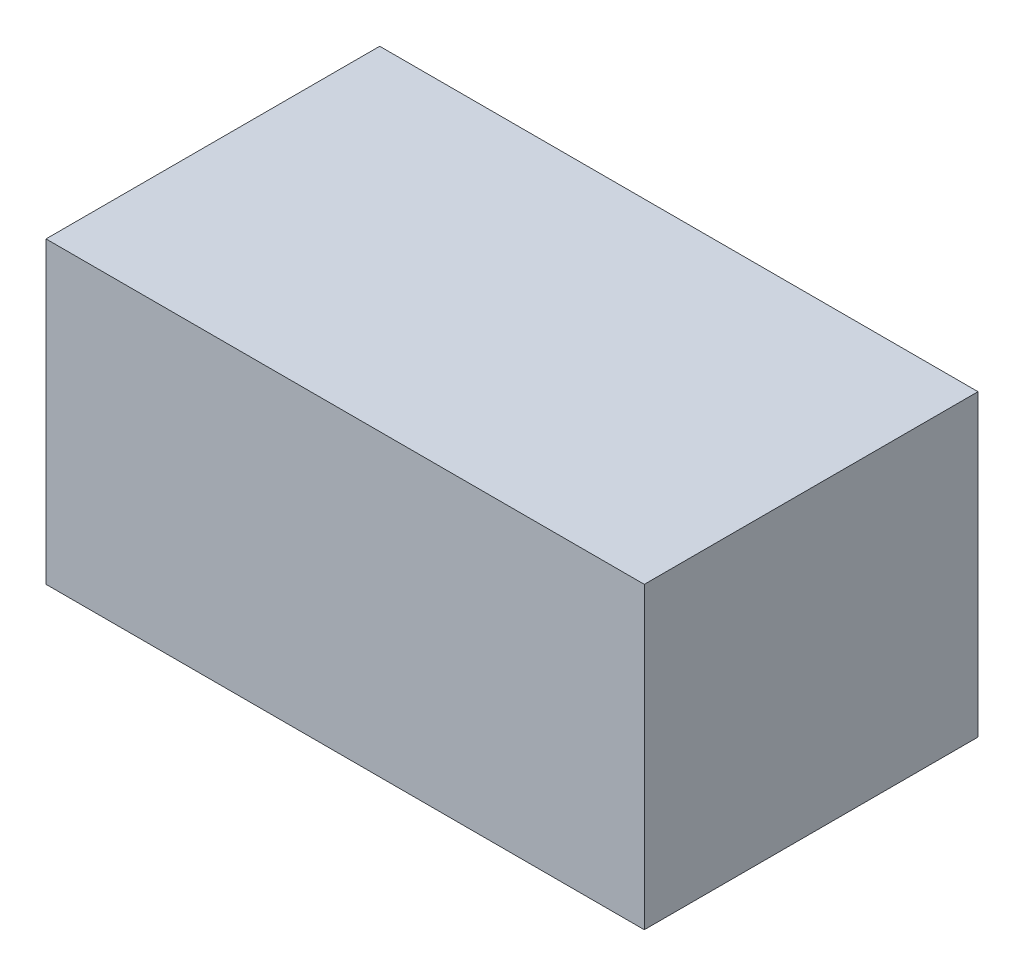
ISO-10303-21;
HEADER;
FILE_DESCRIPTION(('STEP AP214'),'2;1');
FILE_NAME('part.step','',(''),(''),'','','');
FILE_SCHEMA(('AUTOMOTIVE_DESIGN { 1 0 10303 214 1 1 1 1 }'));
ENDSEC;
DATA;
#1=APPLICATION_CONTEXT('core data for automotive mechanical design processes');
#2=APPLICATION_PROTOCOL_DEFINITION('international standard','automotive_design',2000,#1);
#3=PRODUCT_CONTEXT('',#1,'mechanical');
#4=PRODUCT('Part','Part','',(#3));
#5=PRODUCT_RELATED_PRODUCT_CATEGORY('part','',(#4));
#6=PRODUCT_DEFINITION_FORMATION('','',#4);
#7=PRODUCT_DEFINITION_CONTEXT('part definition',#1,'design');
#8=PRODUCT_DEFINITION('design','',#6,#7);
#9=PRODUCT_DEFINITION_SHAPE('','',#8);
#10=(LENGTH_UNIT() NAMED_UNIT(*) SI_UNIT(.MILLI.,.METRE.));
#11=(NAMED_UNIT(*) PLANE_ANGLE_UNIT() SI_UNIT($,.RADIAN.));
#12=(NAMED_UNIT(*) SI_UNIT($,.STERADIAN.) SOLID_ANGLE_UNIT());
#13=UNCERTAINTY_MEASURE_WITH_UNIT(LENGTH_MEASURE(1.E-05),#10,'distance_accuracy_value','');
#14=(GEOMETRIC_REPRESENTATION_CONTEXT(3) GLOBAL_UNCERTAINTY_ASSIGNED_CONTEXT((#13)) GLOBAL_UNIT_ASSIGNED_CONTEXT((#10,
#11,#12)) REPRESENTATION_CONTEXT('',''));
#15=CARTESIAN_POINT('',(0.,0.,0.));
#16=DIRECTION('',(0.,0.,1.));
#17=DIRECTION('',(1.,0.,0.));
#18=AXIS2_PLACEMENT_3D('',#15,#16,#17);
#19=CARTESIAN_POINT('',(-0.762,0.381,0.84999999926));
#20=DIRECTION('',(1.,0.,0.));
#21=DIRECTION('',(0.,0.,-1.));
#22=AXIS2_PLACEMENT_3D('',#19,#20,#21);
#23=PLANE('',#22);
#24=DIRECTION('',(0.,-1.,0.));
#25=VECTOR('',#24,1.);
#26=CARTESIAN_POINT('',(-0.762,0.381,0.));
#27=LINE('',#26,#25);
#28=CARTESIAN_POINT('',(-0.762,0.381,0.));
#29=VERTEX_POINT('',#28);
#30=CARTESIAN_POINT('',(-0.762,-0.381,0.));
#31=VERTEX_POINT('',#30);
#32=EDGE_CURVE('E96',#29,#31,#27,.T.);
#33=ORIENTED_EDGE('',*,*,#32,.T.);
#34=DIRECTION('',(0.,0.,-1.));
#35=VECTOR('',#34,1.);
#36=CARTESIAN_POINT('',(-0.762,-0.381,0.84999999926));
#37=LINE('',#36,#35);
#38=CARTESIAN_POINT('',(-0.762,-0.381,0.84999999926));
#39=VERTEX_POINT('',#38);
#40=EDGE_CURVE('E11',#39,#31,#37,.T.);
#41=ORIENTED_EDGE('',*,*,#40,.F.);
#42=DIRECTION('',(0.,-1.,0.));
#43=VECTOR('',#42,1.);
#44=CARTESIAN_POINT('',(-0.762,0.381,0.84999999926));
#45=LINE('',#44,#43);
#46=CARTESIAN_POINT('',(-0.762,0.381,0.84999999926));
#47=VERTEX_POINT('',#46);
#48=EDGE_CURVE('E84',#47,#39,#45,.T.);
#49=ORIENTED_EDGE('',*,*,#48,.F.);
#50=DIRECTION('',(0.,0.,-1.));
#51=VECTOR('',#50,1.);
#52=CARTESIAN_POINT('',(-0.762,0.381,0.84999999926));
#53=LINE('',#52,#51);
#54=EDGE_CURVE('E92',#47,#29,#53,.T.);
#55=ORIENTED_EDGE('',*,*,#54,.T.);
#56=EDGE_LOOP('',(#33,#41,#49,#55));
#57=FACE_BOUND('',#56,.T.);
#58=ADVANCED_FACE('F33',(#57),#23,.F.);
#59=CARTESIAN_POINT('',(-0.762,-0.381,0.84999999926));
#60=DIRECTION('',(0.,1.,0.));
#61=DIRECTION('',(0.,0.,1.));
#62=AXIS2_PLACEMENT_3D('',#59,#60,#61);
#63=PLANE('',#62);
#64=DIRECTION('',(1.,0.,0.));
#65=VECTOR('',#64,1.);
#66=CARTESIAN_POINT('',(-0.762,-0.381,0.));
#67=LINE('',#66,#65);
#68=CARTESIAN_POINT('',(0.762,-0.381,0.));
#69=VERTEX_POINT('',#68);
#70=EDGE_CURVE('E88',#31,#69,#67,.T.);
#71=ORIENTED_EDGE('',*,*,#70,.T.);
#72=DIRECTION('',(0.,0.,-1.));
#73=VECTOR('',#72,1.);
#74=CARTESIAN_POINT('',(0.762,-0.381,0.84999999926));
#75=LINE('',#74,#73);
#76=CARTESIAN_POINT('',(0.762,-0.381,0.84999999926));
#77=VERTEX_POINT('',#76);
#78=EDGE_CURVE('E41',#77,#69,#75,.T.);
#79=ORIENTED_EDGE('',*,*,#78,.F.);
#80=DIRECTION('',(1.,0.,0.));
#81=VECTOR('',#80,1.);
#82=CARTESIAN_POINT('',(-0.762,-0.381,0.84999999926));
#83=LINE('',#82,#81);
#84=EDGE_CURVE('E79',#39,#77,#83,.T.);
#85=ORIENTED_EDGE('',*,*,#84,.F.);
#86=ORIENTED_EDGE('',*,*,#40,.T.);
#87=EDGE_LOOP('',(#71,#79,#85,#86));
#88=FACE_BOUND('',#87,.T.);
#89=ADVANCED_FACE('F87',(#88),#63,.F.);
#90=CARTESIAN_POINT('',(0.762,-0.381,0.84999999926));
#91=DIRECTION('',(-1.,0.,0.));
#92=DIRECTION('',(0.,0.,1.));
#93=AXIS2_PLACEMENT_3D('',#90,#91,#92);
#94=PLANE('',#93);
#95=DIRECTION('',(0.,1.,0.));
#96=VECTOR('',#95,1.);
#97=CARTESIAN_POINT('',(0.762,-0.381,0.));
#98=LINE('',#97,#96);
#99=CARTESIAN_POINT('',(0.762,0.381,0.));
#100=VERTEX_POINT('',#99);
#101=EDGE_CURVE('E66',#69,#100,#98,.T.);
#102=ORIENTED_EDGE('',*,*,#101,.T.);
#103=DIRECTION('',(0.,0.,-1.));
#104=VECTOR('',#103,1.);
#105=CARTESIAN_POINT('',(0.762,0.381,0.84999999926));
#106=LINE('',#105,#104);
#107=CARTESIAN_POINT('',(0.762,0.381,0.84999999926));
#108=VERTEX_POINT('',#107);
#109=EDGE_CURVE('E89',#108,#100,#106,.T.);
#110=ORIENTED_EDGE('',*,*,#109,.F.);
#111=DIRECTION('',(0.,1.,0.));
#112=VECTOR('',#111,1.);
#113=CARTESIAN_POINT('',(0.762,-0.381,0.84999999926));
#114=LINE('',#113,#112);
#115=EDGE_CURVE('E82',#77,#108,#114,.T.);
#116=ORIENTED_EDGE('',*,*,#115,.F.);
#117=ORIENTED_EDGE('',*,*,#78,.T.);
#118=EDGE_LOOP('',(#102,#110,#116,#117));
#119=FACE_BOUND('',#118,.T.);
#120=ADVANCED_FACE('F90',(#119),#94,.F.);
#121=CARTESIAN_POINT('',(0.762,0.381,0.84999999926));
#122=DIRECTION('',(0.,-1.,0.));
#123=DIRECTION('',(0.,0.,-1.));
#124=AXIS2_PLACEMENT_3D('',#121,#122,#123);
#125=PLANE('',#124);
#126=DIRECTION('',(-1.,0.,0.));
#127=VECTOR('',#126,1.);
#128=CARTESIAN_POINT('',(0.762,0.381,0.));
#129=LINE('',#128,#127);
#130=EDGE_CURVE('E72',#100,#29,#129,.T.);
#131=ORIENTED_EDGE('',*,*,#130,.T.);
#132=ORIENTED_EDGE('',*,*,#54,.F.);
#133=DIRECTION('',(-1.,0.,0.));
#134=VECTOR('',#133,1.);
#135=CARTESIAN_POINT('',(0.762,0.381,0.84999999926));
#136=LINE('',#135,#134);
#137=EDGE_CURVE('E49',#108,#47,#136,.T.);
#138=ORIENTED_EDGE('',*,*,#137,.F.);
#139=ORIENTED_EDGE('',*,*,#109,.T.);
#140=EDGE_LOOP('',(#131,#132,#138,#139));
#141=FACE_BOUND('',#140,.T.);
#142=ADVANCED_FACE('F103',(#141),#125,.F.);
#143=CARTESIAN_POINT('',(0.,0.,0.84999999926));
#144=DIRECTION('',(0.,0.,1.));
#145=DIRECTION('',(1.,0.,0.));
#146=AXIS2_PLACEMENT_3D('',#143,#144,#145);
#147=PLANE('',#146);
#148=ORIENTED_EDGE('',*,*,#48,.T.);
#149=ORIENTED_EDGE('',*,*,#84,.T.);
#150=ORIENTED_EDGE('',*,*,#115,.T.);
#151=ORIENTED_EDGE('',*,*,#137,.T.);
#152=EDGE_LOOP('',(#148,#149,#150,#151));
#153=FACE_BOUND('',#152,.T.);
#154=ADVANCED_FACE('F80',(#153),#147,.T.);
#155=CARTESIAN_POINT('',(0.,0.,0.));
#156=DIRECTION('',(0.,0.,1.));
#157=DIRECTION('',(1.,0.,0.));
#158=AXIS2_PLACEMENT_3D('',#155,#156,#157);
#159=PLANE('',#158);
#160=ORIENTED_EDGE('',*,*,#32,.F.);
#161=ORIENTED_EDGE('',*,*,#130,.F.);
#162=ORIENTED_EDGE('',*,*,#101,.F.);
#163=ORIENTED_EDGE('',*,*,#70,.F.);
#164=EDGE_LOOP('',(#160,#161,#162,#163));
#165=FACE_BOUND('',#164,.T.);
#166=ADVANCED_FACE('F106',(#165),#159,.F.);
#167=CLOSED_SHELL('',(#58,#89,#120,#142,#154,#166));
#168=MANIFOLD_SOLID_BREP('B2',#167);
#169=ADVANCED_BREP_SHAPE_REPRESENTATION('',(#18,#168),#14);
#170=SHAPE_DEFINITION_REPRESENTATION(#9,#169);
ENDSEC;
END-ISO-10303-21;
